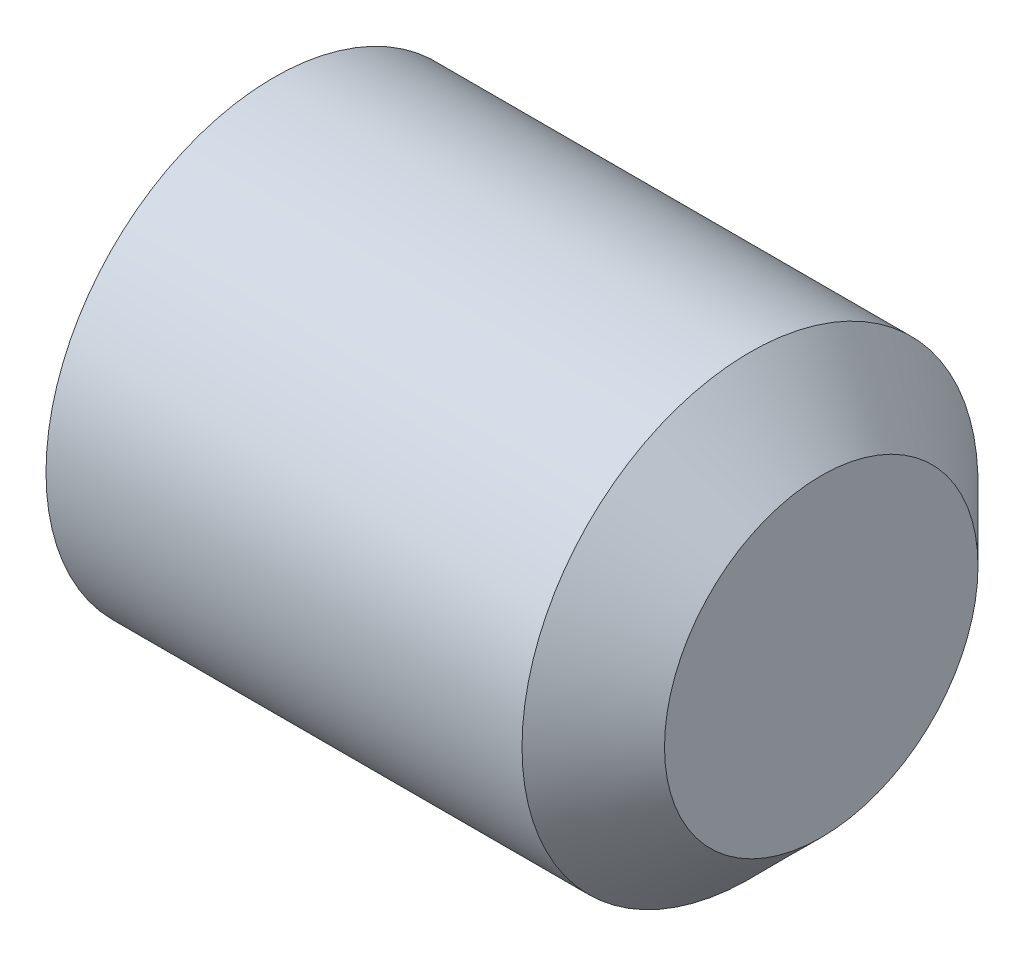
from build123d import *

# Parameters (mm, degrees)
HEX_2_DEPTH = 5


with BuildPart() as part:
    # BodySke → BaseBody (revolve)
    with BuildSketch(Plane.XY, mode=Mode.PRIVATE) as basebody_sk:
        Polygon((0, 0), (0, 3.3095), (0.398660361, 4), (8.75, 4), (10, 2.75), (10, 0), align=None)
    revolve(basebody_sk.sketch.rotate(Axis((-12.7, 0, 0), (1, 0, 0)), 90), axis=Axis((-12.7, 0, 0), (1, 0, 0)))

    # Sketch2 → Hex 2 (cut)
    with BuildSketch(Plane.ZY):
        Polygon((1.154700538, 2), (-1.154700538, 2), (-2.309401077, 0), (-1.154700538, -2), (1.154700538, -2), (2.309401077, 0), align=None)
    extrude(amount=-HEX_2_DEPTH, mode=Mode.SUBTRACT)


solid = part.part
